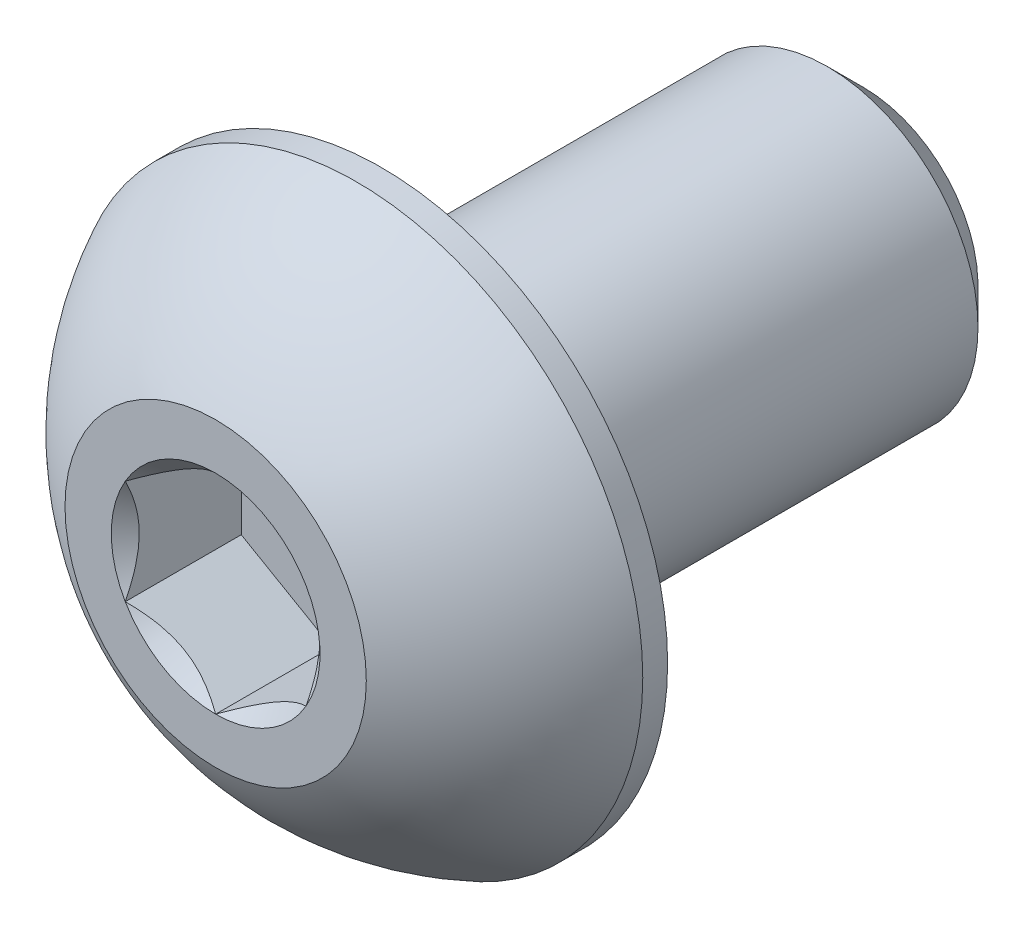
ISO-10303-21;
HEADER;
FILE_DESCRIPTION(('STEP AP214'),'2;1');
FILE_NAME('part.step','',(''),(''),'','','');
FILE_SCHEMA(('AUTOMOTIVE_DESIGN { 1 0 10303 214 1 1 1 1 }'));
ENDSEC;
DATA;
#1=APPLICATION_CONTEXT('core data for automotive mechanical design processes');
#2=APPLICATION_PROTOCOL_DEFINITION('international standard','automotive_design',2000,#1);
#3=PRODUCT_CONTEXT('',#1,'mechanical');
#4=PRODUCT('Part','Part','',(#3));
#5=PRODUCT_RELATED_PRODUCT_CATEGORY('part','',(#4));
#6=PRODUCT_DEFINITION_FORMATION('','',#4);
#7=PRODUCT_DEFINITION_CONTEXT('part definition',#1,'design');
#8=PRODUCT_DEFINITION('design','',#6,#7);
#9=PRODUCT_DEFINITION_SHAPE('','',#8);
#10=(LENGTH_UNIT() NAMED_UNIT(*) SI_UNIT(.MILLI.,.METRE.));
#11=(NAMED_UNIT(*) PLANE_ANGLE_UNIT() SI_UNIT($,.RADIAN.));
#12=(NAMED_UNIT(*) SI_UNIT($,.STERADIAN.) SOLID_ANGLE_UNIT());
#13=UNCERTAINTY_MEASURE_WITH_UNIT(LENGTH_MEASURE(1.E-05),#10,'distance_accuracy_value','');
#14=(GEOMETRIC_REPRESENTATION_CONTEXT(3) GLOBAL_UNCERTAINTY_ASSIGNED_CONTEXT((#13)) GLOBAL_UNIT_ASSIGNED_CONTEXT((#10,
#11,#12)) REPRESENTATION_CONTEXT('',''));
#15=CARTESIAN_POINT('',(0.,0.,0.));
#16=DIRECTION('',(0.,0.,1.));
#17=DIRECTION('',(1.,0.,0.));
#18=AXIS2_PLACEMENT_3D('',#15,#16,#17);
#19=CARTESIAN_POINT('',(0.,-2.50000000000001,-10.75));
#20=DIRECTION('',(0.,0.,-1.));
#21=DIRECTION('',(0.,1.,0.));
#22=AXIS2_PLACEMENT_3D('',#19,#20,#21);
#23=PLANE('',#22);
#24=CARTESIAN_POINT('',(0.,0.,-10.75));
#25=DIRECTION('',(0.,0.,-1.));
#26=DIRECTION('',(0.,1.,0.));
#27=AXIS2_PLACEMENT_3D('',#24,#25,#26);
#28=CIRCLE('',#27,1.90000000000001);
#29=CARTESIAN_POINT('',(0.,1.90000000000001,-10.75));
#30=VERTEX_POINT('',#29);
#31=EDGE_CURVE('E175',#30,#30,#28,.T.);
#32=ORIENTED_EDGE('',*,*,#31,.T.);
#33=EDGE_LOOP('',(#32));
#34=FACE_BOUND('',#33,.T.);
#35=ADVANCED_FACE('F35',(#34),#23,.T.);
#36=CARTESIAN_POINT('',(0.,0.,-10.75));
#37=DIRECTION('',(0.,0.,-1.));
#38=DIRECTION('',(0.,1.,0.));
#39=AXIS2_PLACEMENT_3D('',#36,#37,#38);
#40=CYLINDRICAL_SURFACE('',#39,2.5);
#41=CARTESIAN_POINT('',(0.,0.,-10.15));
#42=DIRECTION('',(0.,0.,-1.));
#43=DIRECTION('',(0.,1.,0.));
#44=AXIS2_PLACEMENT_3D('',#41,#42,#43);
#45=CIRCLE('',#44,2.5);
#46=CARTESIAN_POINT('',(0.,2.5,-10.15));
#47=VERTEX_POINT('',#46);
#48=EDGE_CURVE('E49',#47,#47,#45,.F.);
#49=ORIENTED_EDGE('',*,*,#48,.T.);
#50=EDGE_LOOP('',(#49));
#51=FACE_BOUND('',#50,.T.);
#52=CARTESIAN_POINT('',(0.,0.,-2.75));
#53=DIRECTION('',(0.,0.,1.));
#54=DIRECTION('',(1.,0.,0.));
#55=AXIS2_PLACEMENT_3D('',#52,#53,#54);
#56=CIRCLE('',#55,2.5);
#57=CARTESIAN_POINT('',(2.5,0.,-2.75));
#58=VERTEX_POINT('',#57);
#59=EDGE_CURVE('E172',#58,#58,#56,.F.);
#60=ORIENTED_EDGE('',*,*,#59,.T.);
#61=EDGE_LOOP('',(#60));
#62=FACE_BOUND('',#61,.T.);
#63=ADVANCED_FACE('F180',(#51,#62),#40,.T.);
#64=CARTESIAN_POINT('',(0.,0.,-10.75));
#65=DIRECTION('',(0.,0.,1.));
#66=DIRECTION('',(0.,-1.,0.));
#67=AXIS2_PLACEMENT_3D('',#64,#65,#66);
#68=CONICAL_SURFACE('',#67,1.90000000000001,0.785398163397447);
#69=ORIENTED_EDGE('',*,*,#48,.F.);
#70=EDGE_LOOP('',(#69));
#71=FACE_BOUND('',#70,.T.);
#72=ORIENTED_EDGE('',*,*,#31,.F.);
#73=EDGE_LOOP('',(#72));
#74=FACE_BOUND('',#73,.T.);
#75=ADVANCED_FACE('F37',(#71,#74),#68,.T.);
#76=CARTESIAN_POINT('',(0.,0.,-4.65805481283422));
#77=DIRECTION('',(0.,0.,1.));
#78=DIRECTION('',(0.,-1.,0.));
#79=AXIS2_PLACEMENT_3D('',#76,#77,#78);
#80=SPHERICAL_SURFACE('',#79,5.28653711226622);
#81=CARTESIAN_POINT('',(0.,0.,0.));
#82=DIRECTION('',(0.,0.,1.));
#83=DIRECTION('',(1.,0.,0.));
#84=AXIS2_PLACEMENT_3D('',#81,#82,#83);
#85=CIRCLE('',#84,2.5);
#86=CARTESIAN_POINT('',(0.,-2.50000000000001,0.));
#87=VERTEX_POINT('',#86);
#88=EDGE_CURVE('E169',#87,#87,#85,.T.);
#89=CARTESIAN_POINT('',(0.,0.,-2.3375));
#90=DIRECTION('',(0.,0.,1.));
#91=DIRECTION('',(1.,0.,0.));
#92=AXIS2_PLACEMENT_3D('',#89,#90,#91);
#93=CIRCLE('',#92,4.75);
#94=CARTESIAN_POINT('',(0.,-4.75,-2.3375));
#95=VERTEX_POINT('',#94);
#96=EDGE_CURVE('E163',#95,#95,#93,.T.);
#97=CARTESIAN_POINT('',(0.,-2.50000000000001,0.));
#98=CARTESIAN_POINT('',(0.,-2.53026679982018,-0.0162442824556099));
#99=CARTESIAN_POINT('',(0.,-2.56037522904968,-0.0327836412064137));
#100=CARTESIAN_POINT('',(0.,-2.62026400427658,-0.066446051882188));
#101=CARTESIAN_POINT('',(0.,-2.65004435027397,-0.0835691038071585));
#102=CARTESIAN_POINT('',(0.,-2.70926561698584,-0.118392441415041));
#103=CARTESIAN_POINT('',(0.,-2.73870653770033,-0.136092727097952));
#104=CARTESIAN_POINT('',(0.,-2.79723777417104,-0.172063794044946));
#105=CARTESIAN_POINT('',(0.,-2.82632808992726,-0.190334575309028));
#106=CARTESIAN_POINT('',(0.,-2.8841470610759,-0.227439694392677));
#107=CARTESIAN_POINT('',(0.,-2.91287571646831,-0.246274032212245));
#108=CARTESIAN_POINT('',(0.,-2.96996045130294,-0.284499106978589));
#109=CARTESIAN_POINT('',(0.,-2.99831653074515,-0.303889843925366));
#110=CARTESIAN_POINT('',(0.,-3.05464533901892,-0.343220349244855));
#111=CARTESIAN_POINT('',(0.,-3.08261806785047,-0.363160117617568));
#112=CARTESIAN_POINT('',(0.,-3.13816954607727,-0.403581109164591));
#113=CARTESIAN_POINT('',(0.,-3.16574829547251,-0.424062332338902));
#114=CARTESIAN_POINT('',(0.,-3.22050133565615,-0.465558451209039));
#115=CARTESIAN_POINT('',(0.,-3.24767562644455,-0.486573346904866));
#116=CARTESIAN_POINT('',(0.,-3.30160942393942,-0.529128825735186));
#117=CARTESIAN_POINT('',(0.,-3.32836893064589,-0.550669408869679));
#118=CARTESIAN_POINT('',(0.,-3.38146299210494,-0.594268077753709));
#119=CARTESIAN_POINT('',(0.,-3.40779754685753,-0.616326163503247));
#120=CARTESIAN_POINT('',(0.,-3.46003169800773,-0.660951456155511));
#121=CARTESIAN_POINT('',(0.,-3.48593129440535,-0.683518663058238));
#122=CARTESIAN_POINT('',(0.,-3.53728568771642,-0.72915362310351));
#123=CARTESIAN_POINT('',(0.,-3.56274048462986,-0.752221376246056));
#124=CARTESIAN_POINT('',(0.,-3.61319560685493,-0.79884866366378));
#125=CARTESIAN_POINT('',(0.,-3.63819593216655,-0.822408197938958));
#126=CARTESIAN_POINT('',(0.,-3.68773261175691,-0.870010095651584));
#127=CARTESIAN_POINT('',(0.,-3.71226896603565,-0.894052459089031));
#128=CARTESIAN_POINT('',(0.,-3.76086838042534,-0.942610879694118));
#129=CARTESIAN_POINT('',(0.,-3.78493144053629,-0.967126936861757));
#130=CARTESIAN_POINT('',(0.,-3.83257512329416,-1.01662342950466));
#131=CARTESIAN_POINT('',(0.,-3.85615574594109,-1.04160386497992));
#132=CARTESIAN_POINT('',(0.,-3.90282559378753,-1.0920196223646));
#133=CARTESIAN_POINT('',(0.,-3.92591481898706,-1.11745494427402));
#134=CARTESIAN_POINT('',(0.,-3.97159309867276,-1.1687708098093));
#135=CARTESIAN_POINT('',(0.,-3.99418215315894,-1.19465135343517));
#136=CARTESIAN_POINT('',(0.,-4.03885150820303,-1.24684782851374));
#137=CARTESIAN_POINT('',(0.,-4.06093180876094,-1.27316375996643));
#138=CARTESIAN_POINT('',(0.,-4.10457526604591,-1.32622101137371));
#139=CARTESIAN_POINT('',(0.,-4.12613842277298,-1.3529623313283));
#140=CARTESIAN_POINT('',(0.,-4.16873939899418,-1.40686019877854));
#141=CARTESIAN_POINT('',(0.,-4.1897772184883,-1.4340167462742));
#142=CARTESIAN_POINT('',(0.,-4.23131952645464,-1.488734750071));
#143=CARTESIAN_POINT('',(0.,-4.25182401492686,-1.51629620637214));
#144=CARTESIAN_POINT('',(0.,-4.29229186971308,-1.5718135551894));
#145=CARTESIAN_POINT('',(0.,-4.31225523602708,-1.59976944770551));
#146=CARTESIAN_POINT('',(0.,-4.35163326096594,-1.65606504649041));
#147=CARTESIAN_POINT('',(0.,-4.3710479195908,-1.6844047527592));
#148=CARTESIAN_POINT('',(0.,-4.40932115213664,-1.74145721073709));
#149=CARTESIAN_POINT('',(0.,-4.42817972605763,-1.77016996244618));
#150=CARTESIAN_POINT('',(0.,-4.46533362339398,-1.82795760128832));
#151=CARTESIAN_POINT('',(0.,-4.48362894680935,-1.85703248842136));
#152=CARTESIAN_POINT('',(0.,-4.51964939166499,-1.91553335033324));
#153=CARTESIAN_POINT('',(0.,-4.53737451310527,-1.94495932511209));
#154=CARTESIAN_POINT('',(0.,-4.57224781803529,-2.00415118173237));
#155=CARTESIAN_POINT('',(0.,-4.58939600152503,-2.03391706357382));
#156=CARTESIAN_POINT('',(0.,-4.62310891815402,-2.09377742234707));
#157=CARTESIAN_POINT('',(0.,-4.63967365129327,-2.12387189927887));
#158=CARTESIAN_POINT('',(0.,-4.67221336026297,-2.18437801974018));
#159=CARTESIAN_POINT('',(0.,-4.68818833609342,-2.21478966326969));
#160=CARTESIAN_POINT('',(0.,-4.71954250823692,-2.27591853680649));
#161=CARTESIAN_POINT('',(0.,-4.73492170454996,-2.30663576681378));
#162=CARTESIAN_POINT('',(0.,-4.75,-2.3375));
#163=B_SPLINE_CURVE_WITH_KNOTS('',3,(#97,#98,#99,#100,#101,#102,#103,#104,#105,#106,#107,#108,
#109,#110,#111,#112,#113,#114,#115,#116,#117,#118,#119,#120,#121,#122,#123,#124,#125,#126,#127,
#128,#129,#130,#131,#132,#133,#134,#135,#136,#137,#138,#139,#140,#141,#142,#143,#144,#145,#146,
#147,#148,#149,#150,#151,#152,#153,#154,#155,#156,#157,#158,#159,#160,#161,#162),.UNSPECIFIED.,
.F.,.F.,(4,2,2,2,2,2,2,2,2,2,2,2,2,2,2,2,2,2,2,2,2,2,2,2,2,2,2,2,2,2,2,2,4),(0.,
0.10304982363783,0.206099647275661,0.309149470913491,0.412199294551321,0.515249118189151,
0.618298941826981,0.721348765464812,0.824398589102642,0.927448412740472,1.0304982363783,
1.13354806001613,1.23659788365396,1.33964770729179,1.44269753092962,1.54574735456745,
1.64879717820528,1.75184700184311,1.85489682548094,1.95794664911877,2.0609964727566,
2.16404629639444,2.26709612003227,2.3701459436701,2.47319576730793,2.57624559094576,
2.67929541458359,2.78234523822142,2.88539506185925,2.98844488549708,3.09149470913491,
3.19454453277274,3.29759435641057),.UNSPECIFIED.);
#164=EDGE_CURVE('BSEAM185',#87,#95,#163,.T.);
#165=ORIENTED_EDGE('',*,*,#88,.F.);
#166=ORIENTED_EDGE('',*,*,#96,.T.);
#167=ORIENTED_EDGE('',*,*,#164,.T.);
#168=ORIENTED_EDGE('',*,*,#164,.F.);
#169=EDGE_LOOP('',(#165,#167,#166,#168));
#170=FACE_BOUND('',#169,.T.);
#171=ADVANCED_FACE('F185',(#170),#80,.T.);
#172=CARTESIAN_POINT('',(0.,-2.5,0.));
#173=DIRECTION('',(0.,0.,-1.));
#174=DIRECTION('',(-1.,0.,0.));
#175=AXIS2_PLACEMENT_3D('',#172,#173,#174);
#176=PLANE('',#175);
#177=CARTESIAN_POINT('',(0.,0.,0.));
#178=DIRECTION('',(0.,0.,1.));
#179=DIRECTION('',(1.,0.,0.));
#180=AXIS2_PLACEMENT_3D('',#177,#178,#179);
#181=CIRCLE('',#180,1.73205080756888);
#182=CARTESIAN_POINT('',(-1.5,0.866025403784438,0.));
#183=VERTEX_POINT('',#182);
#184=CARTESIAN_POINT('',(-1.5,-0.866025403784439,0.));
#185=VERTEX_POINT('',#184);
#186=EDGE_CURVE('E62',#183,#185,#181,.T.);
#187=ORIENTED_EDGE('',*,*,#186,.F.);
#188=CARTESIAN_POINT('',(0.,1.73205080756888,0.));
#189=VERTEX_POINT('',#188);
#190=EDGE_CURVE('E134',#189,#183,#181,.T.);
#191=ORIENTED_EDGE('',*,*,#190,.F.);
#192=CARTESIAN_POINT('',(1.5,0.866025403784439,0.));
#193=VERTEX_POINT('',#192);
#194=EDGE_CURVE('E131',#193,#189,#181,.T.);
#195=ORIENTED_EDGE('',*,*,#194,.F.);
#196=CARTESIAN_POINT('',(1.5,-0.866025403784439,0.));
#197=VERTEX_POINT('',#196);
#198=EDGE_CURVE('E102',#197,#193,#181,.T.);
#199=ORIENTED_EDGE('',*,*,#198,.F.);
#200=CARTESIAN_POINT('',(0.,-1.73205080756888,0.));
#201=VERTEX_POINT('',#200);
#202=EDGE_CURVE('E94',#201,#197,#181,.T.);
#203=ORIENTED_EDGE('',*,*,#202,.F.);
#204=EDGE_CURVE('E55',#185,#201,#181,.T.);
#205=ORIENTED_EDGE('',*,*,#204,.F.);
#206=EDGE_LOOP('',(#187,#191,#195,#199,#203,#205));
#207=FACE_BOUND('',#206,.T.);
#208=ORIENTED_EDGE('',*,*,#88,.T.);
#209=EDGE_LOOP('',(#208));
#210=FACE_BOUND('',#209,.T.);
#211=ADVANCED_FACE('F128',(#207,#210),#176,.F.);
#212=CARTESIAN_POINT('',(0.,-4.75,-2.75));
#213=DIRECTION('',(0.,0.,1.));
#214=DIRECTION('',(1.,0.,0.));
#215=AXIS2_PLACEMENT_3D('',#212,#213,#214);
#216=PLANE('',#215);
#217=ORIENTED_EDGE('',*,*,#59,.F.);
#218=EDGE_LOOP('',(#217));
#219=FACE_BOUND('',#218,.T.);
#220=CARTESIAN_POINT('',(0.,0.,-2.75));
#221=DIRECTION('',(0.,0.,1.));
#222=DIRECTION('',(1.,0.,0.));
#223=AXIS2_PLACEMENT_3D('',#220,#221,#222);
#224=CIRCLE('',#223,4.75);
#225=CARTESIAN_POINT('',(4.75,0.,-2.75));
#226=VERTEX_POINT('',#225);
#227=EDGE_CURVE('E166',#226,#226,#224,.T.);
#228=ORIENTED_EDGE('',*,*,#227,.F.);
#229=EDGE_LOOP('',(#228));
#230=FACE_BOUND('',#229,.T.);
#231=ADVANCED_FACE('F199',(#219,#230),#216,.F.);
#232=CARTESIAN_POINT('',(0.,0.,0.));
#233=DIRECTION('',(0.,0.,1.));
#234=DIRECTION('',(1.,0.,0.));
#235=AXIS2_PLACEMENT_3D('',#232,#233,#234);
#236=CYLINDRICAL_SURFACE('',#235,4.75);
#237=ORIENTED_EDGE('',*,*,#96,.F.);
#238=EDGE_LOOP('',(#237));
#239=FACE_BOUND('',#238,.T.);
#240=ORIENTED_EDGE('',*,*,#227,.T.);
#241=EDGE_LOOP('',(#240));
#242=FACE_BOUND('',#241,.T.);
#243=ADVANCED_FACE('F202',(#239,#242),#236,.T.);
#244=CARTESIAN_POINT('',(0.,0.,0.));
#245=DIRECTION('',(0.,0.,1.));
#246=DIRECTION('',(1.,0.,0.));
#247=AXIS2_PLACEMENT_3D('',#244,#245,#246);
#248=CONICAL_SURFACE('',#247,1.73205080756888,0.78539816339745);
#249=ORIENTED_EDGE('',*,*,#198,.T.);
#250=CARTESIAN_POINT('',(1.5,-1.72720812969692,0.555578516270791));
#251=CARTESIAN_POINT('',(1.5,-1.68515175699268,0.523829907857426));
#252=CARTESIAN_POINT('',(1.5,-1.64286104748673,0.492392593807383));
#253=CARTESIAN_POINT('',(1.5,-1.55771581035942,0.430269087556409));
#254=CARTESIAN_POINT('',(1.5,-1.51486114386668,0.399583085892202));
#255=CARTESIAN_POINT('',(1.5,-1.3846813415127,0.30840719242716));
#256=CARTESIAN_POINT('',(1.5,-1.29637976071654,0.249288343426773));
#257=CARTESIAN_POINT('',(1.5,-1.11121478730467,0.133230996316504));
#258=CARTESIAN_POINT('',(1.5,-1.01415038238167,0.0766095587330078));
#259=CARTESIAN_POINT('',(1.5,-0.815173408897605,-0.0269631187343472));
#260=CARTESIAN_POINT('',(1.5,-0.713278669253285,-0.0739469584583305));
#261=CARTESIAN_POINT('',(1.5,-0.560333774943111,-0.13142733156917));
#262=CARTESIAN_POINT('',(1.5,-0.511547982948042,-0.147924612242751));
#263=CARTESIAN_POINT('',(1.5,-0.412798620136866,-0.177002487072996));
#264=CARTESIAN_POINT('',(1.5,-0.362834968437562,-0.189582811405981));
#265=CARTESIAN_POINT('',(1.5,-0.262863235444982,-0.20996380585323));
#266=CARTESIAN_POINT('',(1.5,-0.212872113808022,-0.21784636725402));
#267=CARTESIAN_POINT('',(1.5,-0.112355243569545,-0.228677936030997));
#268=CARTESIAN_POINT('',(1.5,-0.0618295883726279,-0.231627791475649));
#269=CARTESIAN_POINT('',(1.5,0.037429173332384,-0.23237514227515));
#270=CARTESIAN_POINT('',(1.5,0.0861609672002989,-0.230355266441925));
#271=CARTESIAN_POINT('',(1.5,0.183206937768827,-0.221677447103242));
#272=CARTESIAN_POINT('',(1.5,0.231521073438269,-0.215019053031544));
#273=CARTESIAN_POINT('',(1.5,0.328199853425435,-0.197314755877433));
#274=CARTESIAN_POINT('',(1.5,0.376550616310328,-0.186194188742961));
#275=CARTESIAN_POINT('',(1.5,0.472195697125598,-0.160156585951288));
#276=CARTESIAN_POINT('',(1.5,0.51949010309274,-0.145239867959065));
#277=CARTESIAN_POINT('',(1.5,0.668391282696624,-0.0926647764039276));
#278=CARTESIAN_POINT('',(1.5,0.767878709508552,-0.0490187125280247));
#279=CARTESIAN_POINT('',(1.5,0.962179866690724,0.048022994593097));
#280=CARTESIAN_POINT('',(1.5,1.05697519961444,0.101453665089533));
#281=CARTESIAN_POINT('',(1.5,1.23814273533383,0.211685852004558));
#282=CARTESIAN_POINT('',(1.5,1.3246994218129,0.268187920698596));
#283=CARTESIAN_POINT('',(1.5,1.45222331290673,0.355534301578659));
#284=CARTESIAN_POINT('',(1.5,1.49418091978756,0.384957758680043));
#285=CARTESIAN_POINT('',(1.5,1.57752272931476,0.444582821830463));
#286=CARTESIAN_POINT('',(1.5,1.61890708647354,0.474784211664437));
#287=CARTESIAN_POINT('',(1.5,1.66005278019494,0.505308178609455));
#288=B_SPLINE_CURVE_WITH_KNOTS('',3,(#250,#251,#252,#253,#254,#255,#256,#257,#258,#259,#260,
#261,#262,#263,#264,#265,#266,#267,#268,#269,#270,#271,#272,#273,#274,#275,#276,#277,#278,#279,
#280,#281,#282,#283,#284,#285,#286,#287),.UNSPECIFIED.,.F.,.F.,(4,2,2,2,2,2,2,2,2,2,2,2,2,2,2,2,
2,2,4),(0.,0.158079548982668,0.316198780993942,0.634850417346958,0.97169031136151,
1.30737131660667,1.46173961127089,1.61611853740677,1.7677210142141,1.91929742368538,
2.065387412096,2.21149159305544,2.36014984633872,2.50879566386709,2.83376031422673,
3.15991186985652,3.46985601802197,3.62358896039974,3.7772796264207),.UNSPECIFIED.);
#289=EDGE_CURVE('E11',#197,#193,#288,.T.);
#290=ORIENTED_EDGE('',*,*,#289,.F.);
#291=EDGE_LOOP('',(#249,#290));
#292=FACE_BOUND('',#291,.T.);
#293=ADVANCED_FACE('F106',(#292),#248,.F.);
#294=ORIENTED_EDGE('',*,*,#194,.T.);
#295=CARTESIAN_POINT('',(1.5002,0.865909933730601,0.000115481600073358));
#296=CARTESIAN_POINT('',(1.44863220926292,0.895682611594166,-0.0296345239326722));
#297=CARTESIAN_POINT('',(1.3962020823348,0.925953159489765,-0.0576375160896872));
#298=CARTESIAN_POINT('',(1.2892909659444,0.987678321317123,-0.108910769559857));
#299=CARTESIAN_POINT('',(1.23479980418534,1.01913880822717,-0.132152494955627));
#300=CARTESIAN_POINT('',(1.12492091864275,1.08257741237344,-0.17196627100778));
#301=CARTESIAN_POINT('',(1.0695611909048,1.11453936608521,-0.188638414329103));
#302=CARTESIAN_POINT('',(0.95762274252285,1.1791670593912,-0.214325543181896));
#303=CARTESIAN_POINT('',(0.901047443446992,1.21183082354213,-0.223359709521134));
#304=CARTESIAN_POINT('',(0.80354461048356,1.26812411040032,-0.231510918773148));
#305=CARTESIAN_POINT('',(0.762743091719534,1.29168087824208,-0.232717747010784));
#306=CARTESIAN_POINT('',(0.681212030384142,1.33875285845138,-0.230685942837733));
#307=CARTESIAN_POINT('',(0.64048250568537,1.36226806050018,-0.227446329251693));
#308=CARTESIAN_POINT('',(0.559415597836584,1.40907206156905,-0.216708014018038));
#309=CARTESIAN_POINT('',(0.519078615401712,1.43236062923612,-0.209205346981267));
#310=CARTESIAN_POINT('',(0.43908166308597,1.47854689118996,-0.19034838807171));
#311=CARTESIAN_POINT('',(0.399421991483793,1.50144441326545,-0.178992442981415));
#312=CARTESIAN_POINT('',(0.297836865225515,1.56009461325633,-0.145278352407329));
#313=CARTESIAN_POINT('',(0.236541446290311,1.59548353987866,-0.120378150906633));
#314=CARTESIAN_POINT('',(0.146414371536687,1.64751843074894,-0.078343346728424));
#315=CARTESIAN_POINT('',(0.116714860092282,1.66466545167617,-0.0635748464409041));
#316=CARTESIAN_POINT('',(0.0578620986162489,1.69864410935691,-0.0326894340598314));
#317=CARTESIAN_POINT('',(0.0287085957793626,1.71547589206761,-0.0165731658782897));
#318=CARTESIAN_POINT('',(-0.000200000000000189,1.73216627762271,0.000115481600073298));
#319=B_SPLINE_CURVE_WITH_KNOTS('',3,(#295,#296,#297,#298,#299,#300,#301,#302,#303,#304,#305,
#306,#307,#308,#309,#310,#311,#312,#313,#314,#315,#316,#317,#318),.UNSPECIFIED.,.F.,.F.,(4,2,2,
2,2,2,2,2,2,2,2,4),(0.,0.199829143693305,0.400822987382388,0.59862372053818,0.795926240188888,
0.93711306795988,1.07833105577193,1.21968061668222,1.36109089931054,1.58570969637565,
1.69770705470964,1.80965120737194),.UNSPECIFIED.);
#320=EDGE_CURVE('E133',#193,#189,#319,.T.);
#321=ORIENTED_EDGE('',*,*,#320,.F.);
#322=EDGE_LOOP('',(#294,#321));
#323=FACE_BOUND('',#322,.T.);
#324=ADVANCED_FACE('F287',(#323),#248,.F.);
#325=ORIENTED_EDGE('',*,*,#190,.T.);
#326=CARTESIAN_POINT('',(0.000199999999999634,1.73216627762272,0.000115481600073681));
#327=CARTESIAN_POINT('',(-0.0513677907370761,1.70239359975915,-0.029634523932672));
#328=CARTESIAN_POINT('',(-0.103797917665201,1.67212305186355,-0.0576375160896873));
#329=CARTESIAN_POINT('',(-0.210709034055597,1.61039789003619,-0.108910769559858));
#330=CARTESIAN_POINT('',(-0.265200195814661,1.57893740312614,-0.132152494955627));
#331=CARTESIAN_POINT('',(-0.375079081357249,1.51549879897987,-0.17196627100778));
#332=CARTESIAN_POINT('',(-0.4304388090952,1.4835368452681,-0.188638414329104));
#333=CARTESIAN_POINT('',(-0.542377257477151,1.41890915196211,-0.214325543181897));
#334=CARTESIAN_POINT('',(-0.598952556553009,1.38624538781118,-0.223359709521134));
#335=CARTESIAN_POINT('',(-0.696455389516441,1.32995210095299,-0.231510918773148));
#336=CARTESIAN_POINT('',(-0.737256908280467,1.30639533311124,-0.232717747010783));
#337=CARTESIAN_POINT('',(-0.818787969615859,1.25932335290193,-0.230685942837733));
#338=CARTESIAN_POINT('',(-0.859517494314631,1.23580815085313,-0.227446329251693));
#339=CARTESIAN_POINT('',(-0.940584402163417,1.18900414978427,-0.216708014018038));
#340=CARTESIAN_POINT('',(-0.980921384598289,1.16571558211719,-0.209205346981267));
#341=CARTESIAN_POINT('',(-1.06091833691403,1.11952932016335,-0.19034838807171));
#342=CARTESIAN_POINT('',(-1.10057800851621,1.09663179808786,-0.178992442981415));
#343=CARTESIAN_POINT('',(-1.20216313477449,1.03798159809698,-0.145278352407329));
#344=CARTESIAN_POINT('',(-1.26345855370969,1.00259267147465,-0.120378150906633));
#345=CARTESIAN_POINT('',(-1.35358562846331,0.950557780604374,-0.0783433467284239));
#346=CARTESIAN_POINT('',(-1.38328513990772,0.933410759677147,-0.0635748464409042));
#347=CARTESIAN_POINT('',(-1.44213790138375,0.899432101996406,-0.0326894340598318));
#348=CARTESIAN_POINT('',(-1.47129140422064,0.882600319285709,-0.0165731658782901));
#349=CARTESIAN_POINT('',(-1.5002,0.8659099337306,0.000115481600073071));
#350=B_SPLINE_CURVE_WITH_KNOTS('',3,(#326,#327,#328,#329,#330,#331,#332,#333,#334,#335,#336,
#337,#338,#339,#340,#341,#342,#343,#344,#345,#346,#347,#348,#349),.UNSPECIFIED.,.F.,.F.,(4,2,2,
2,2,2,2,2,2,2,2,4),(0.,0.199829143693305,0.400822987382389,0.598623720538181,0.79592624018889,
0.937113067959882,1.07833105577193,1.21968061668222,1.36109089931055,1.58570969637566,
1.69770705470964,1.80965120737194),.UNSPECIFIED.);
#351=EDGE_CURVE('E138',#189,#183,#350,.T.);
#352=ORIENTED_EDGE('',*,*,#351,.F.);
#353=EDGE_LOOP('',(#325,#352));
#354=FACE_BOUND('',#353,.T.);
#355=ADVANCED_FACE('F141',(#354),#248,.F.);
#356=ORIENTED_EDGE('',*,*,#186,.T.);
#357=CARTESIAN_POINT('',(-1.5,-1.72720812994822,0.555578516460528));
#358=CARTESIAN_POINT('',(-1.5,-1.68515175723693,0.523829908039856));
#359=CARTESIAN_POINT('',(-1.5,-1.64286104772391,0.492392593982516));
#360=CARTESIAN_POINT('',(-1.5,-1.55771581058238,0.430269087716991));
#361=CARTESIAN_POINT('',(-1.5,-1.5148611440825,0.39958308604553));
#362=CARTESIAN_POINT('',(-1.5,-1.38468134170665,0.308407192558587));
#363=CARTESIAN_POINT('',(-1.5,-1.29637976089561,0.249288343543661));
#364=CARTESIAN_POINT('',(-1.5,-1.11121478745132,0.133230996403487));
#365=CARTESIAN_POINT('',(-1.5,-1.01415038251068,0.0766095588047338));
#366=CARTESIAN_POINT('',(-1.5,-0.815173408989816,-0.0269631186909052));
#367=CARTESIAN_POINT('',(-1.5,-0.713278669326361,-0.0739469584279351));
#368=CARTESIAN_POINT('',(-1.5,-0.56033377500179,-0.131427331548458));
#369=CARTESIAN_POINT('',(-1.5,-0.51154798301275,-0.147924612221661));
#370=CARTESIAN_POINT('',(-1.5,-0.412798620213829,-0.17700248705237));
#371=CARTESIAN_POINT('',(-1.5,-0.362834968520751,-0.189582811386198));
#372=CARTESIAN_POINT('',(-1.5,-0.262863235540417,-0.209963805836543));
#373=CARTESIAN_POINT('',(-1.5,-0.212872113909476,-0.21784636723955));
#374=CARTESIAN_POINT('',(-1.5,-0.112355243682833,-0.228677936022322));
#375=CARTESIAN_POINT('',(-1.5,-0.0618295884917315,-0.231627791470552));
#376=CARTESIAN_POINT('',(-1.5,0.0374291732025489,-0.232375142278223));
#377=CARTESIAN_POINT('',(-1.5,0.0861609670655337,-0.23035526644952));
#378=CARTESIAN_POINT('',(-1.5,0.183206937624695,-0.221677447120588));
#379=CARTESIAN_POINT('',(-1.5,0.2315210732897,-0.215019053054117));
#380=CARTESIAN_POINT('',(-1.5,0.328199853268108,-0.197314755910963));
#381=CARTESIAN_POINT('',(-1.5,0.376550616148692,-0.186194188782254));
#382=CARTESIAN_POINT('',(-1.5,0.47219569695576,-0.160156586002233));
#383=CARTESIAN_POINT('',(-1.5,0.519490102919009,-0.145239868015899));
#384=CARTESIAN_POINT('',(-1.5,0.668391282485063,-0.0926647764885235));
#385=CARTESIAN_POINT('',(-1.5,0.767878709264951,-0.0490187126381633));
#386=CARTESIAN_POINT('',(-1.5,0.9621798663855,0.0480229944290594));
#387=CARTESIAN_POINT('',(-1.5,1.05697519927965,0.101453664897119));
#388=CARTESIAN_POINT('',(-1.5,1.23814273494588,0.211685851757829));
#389=CARTESIAN_POINT('',(-1.5,1.32469942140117,0.268187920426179));
#390=CARTESIAN_POINT('',(-1.5,1.45222331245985,0.355534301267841));
#391=CARTESIAN_POINT('',(-1.5,1.49418091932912,0.384957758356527));
#392=CARTESIAN_POINT('',(-1.5,1.5775227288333,0.444582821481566));
#393=CARTESIAN_POINT('',(-1.5,1.6189070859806,0.474784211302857));
#394=CARTESIAN_POINT('',(-1.5,1.66005277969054,0.505308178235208));
#395=B_SPLINE_CURVE_WITH_KNOTS('',3,(#357,#358,#359,#360,#361,#362,#363,#364,#365,#366,#367,
#368,#369,#370,#371,#372,#373,#374,#375,#376,#377,#378,#379,#380,#381,#382,#383,#384,#385,#386,
#387,#388,#389,#390,#391,#392,#393,#394),.UNSPECIFIED.,.F.,.F.,(4,2,2,2,2,2,2,2,2,2,2,2,2,2,2,2,
2,2,4),(0.,0.158079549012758,0.316198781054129,0.634850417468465,0.971690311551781,
1.30737131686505,1.46173961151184,1.61611853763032,1.76772101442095,1.91929742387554,
2.06538741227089,2.21149159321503,2.36014984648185,2.50879566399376,2.83376031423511,
3.15991186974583,3.4698560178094,3.62358896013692,3.77727962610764),.UNSPECIFIED.);
#396=EDGE_CURVE('E145',#183,#185,#395,.F.);
#397=ORIENTED_EDGE('',*,*,#396,.F.);
#398=EDGE_LOOP('',(#356,#397));
#399=FACE_BOUND('',#398,.T.);
#400=ADVANCED_FACE('F281',(#399),#248,.F.);
#401=ORIENTED_EDGE('',*,*,#204,.T.);
#402=CARTESIAN_POINT('',(-1.5002,-0.865909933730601,0.000115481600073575));
#403=CARTESIAN_POINT('',(-1.44863220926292,-0.895682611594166,-0.029634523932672));
#404=CARTESIAN_POINT('',(-1.3962020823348,-0.925953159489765,-0.0576375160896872));
#405=CARTESIAN_POINT('',(-1.2892909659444,-0.987678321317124,-0.108910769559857));
#406=CARTESIAN_POINT('',(-1.23479980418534,-1.01913880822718,-0.132152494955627));
#407=CARTESIAN_POINT('',(-1.12492091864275,-1.08257741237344,-0.17196627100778));
#408=CARTESIAN_POINT('',(-1.0695611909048,-1.11453936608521,-0.188638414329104));
#409=CARTESIAN_POINT('',(-0.957622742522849,-1.1791670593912,-0.214325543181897));
#410=CARTESIAN_POINT('',(-0.901047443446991,-1.21183082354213,-0.223359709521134));
#411=CARTESIAN_POINT('',(-0.803544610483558,-1.26812411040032,-0.231510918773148));
#412=CARTESIAN_POINT('',(-0.762743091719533,-1.29168087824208,-0.232717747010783));
#413=CARTESIAN_POINT('',(-0.681212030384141,-1.33875285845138,-0.230685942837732));
#414=CARTESIAN_POINT('',(-0.640482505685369,-1.36226806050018,-0.227446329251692));
#415=CARTESIAN_POINT('',(-0.559415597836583,-1.40907206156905,-0.216708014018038));
#416=CARTESIAN_POINT('',(-0.519078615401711,-1.43236062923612,-0.209205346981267));
#417=CARTESIAN_POINT('',(-0.439081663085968,-1.47854689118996,-0.190348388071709));
#418=CARTESIAN_POINT('',(-0.399421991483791,-1.50144441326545,-0.178992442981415));
#419=CARTESIAN_POINT('',(-0.297836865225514,-1.56009461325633,-0.145278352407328));
#420=CARTESIAN_POINT('',(-0.23654144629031,-1.59548353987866,-0.120378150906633));
#421=CARTESIAN_POINT('',(-0.146414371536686,-1.64751843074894,-0.0783433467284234));
#422=CARTESIAN_POINT('',(-0.116714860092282,-1.66466545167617,-0.0635748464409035));
#423=CARTESIAN_POINT('',(-0.0578620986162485,-1.69864410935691,-0.0326894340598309));
#424=CARTESIAN_POINT('',(-0.0287085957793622,-1.71547589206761,-0.0165731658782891));
#425=CARTESIAN_POINT('',(0.00020000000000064,-1.73216627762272,0.000115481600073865));
#426=B_SPLINE_CURVE_WITH_KNOTS('',3,(#402,#403,#404,#405,#406,#407,#408,#409,#410,#411,#412,
#413,#414,#415,#416,#417,#418,#419,#420,#421,#422,#423,#424,#425),.UNSPECIFIED.,.F.,.F.,(4,2,2,
2,2,2,2,2,2,2,2,4),(0.,0.199829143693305,0.400822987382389,0.598623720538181,0.79592624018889,
0.937113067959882,1.07833105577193,1.21968061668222,1.36109089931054,1.58570969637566,
1.69770705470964,1.80965120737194),.UNSPECIFIED.);
#427=EDGE_CURVE('E118',#185,#201,#426,.T.);
#428=ORIENTED_EDGE('',*,*,#427,.F.);
#429=EDGE_LOOP('',(#401,#428));
#430=FACE_BOUND('',#429,.T.);
#431=ADVANCED_FACE('F229',(#430),#248,.F.);
#432=ORIENTED_EDGE('',*,*,#202,.T.);
#433=CARTESIAN_POINT('',(-0.000199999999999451,-1.73216627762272,0.000115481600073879));
#434=CARTESIAN_POINT('',(0.0513677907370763,-1.70239359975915,-0.029634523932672));
#435=CARTESIAN_POINT('',(0.103797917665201,-1.67212305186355,-0.0576375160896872));
#436=CARTESIAN_POINT('',(0.210709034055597,-1.61039789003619,-0.108910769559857));
#437=CARTESIAN_POINT('',(0.265200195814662,-1.57893740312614,-0.132152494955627));
#438=CARTESIAN_POINT('',(0.375079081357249,-1.51549879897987,-0.17196627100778));
#439=CARTESIAN_POINT('',(0.4304388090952,-1.4835368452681,-0.188638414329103));
#440=CARTESIAN_POINT('',(0.542377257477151,-1.41890915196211,-0.214325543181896));
#441=CARTESIAN_POINT('',(0.598952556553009,-1.38624538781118,-0.223359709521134));
#442=CARTESIAN_POINT('',(0.696455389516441,-1.32995210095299,-0.231510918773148));
#443=CARTESIAN_POINT('',(0.737256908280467,-1.30639533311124,-0.232717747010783));
#444=CARTESIAN_POINT('',(0.818787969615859,-1.25932335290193,-0.230685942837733));
#445=CARTESIAN_POINT('',(0.85951749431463,-1.23580815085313,-0.227446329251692));
#446=CARTESIAN_POINT('',(0.940584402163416,-1.18900414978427,-0.216708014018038));
#447=CARTESIAN_POINT('',(0.980921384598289,-1.16571558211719,-0.209205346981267));
#448=CARTESIAN_POINT('',(1.06091833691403,-1.11952932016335,-0.19034838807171));
#449=CARTESIAN_POINT('',(1.10057800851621,-1.09663179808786,-0.178992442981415));
#450=CARTESIAN_POINT('',(1.20216313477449,-1.03798159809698,-0.145278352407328));
#451=CARTESIAN_POINT('',(1.26345855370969,-1.00259267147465,-0.120378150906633));
#452=CARTESIAN_POINT('',(1.35358562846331,-0.950557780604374,-0.0783433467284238));
#453=CARTESIAN_POINT('',(1.38328513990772,-0.933410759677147,-0.063574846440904));
#454=CARTESIAN_POINT('',(1.44213790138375,-0.899432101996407,-0.0326894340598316));
#455=CARTESIAN_POINT('',(1.47129140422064,-0.88260031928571,-0.0165731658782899));
#456=CARTESIAN_POINT('',(1.5002,-0.865909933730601,0.000115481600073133));
#457=B_SPLINE_CURVE_WITH_KNOTS('',3,(#433,#434,#435,#436,#437,#438,#439,#440,#441,#442,#443,
#444,#445,#446,#447,#448,#449,#450,#451,#452,#453,#454,#455,#456),.UNSPECIFIED.,.F.,.F.,(4,2,2,
2,2,2,2,2,2,2,2,4),(0.,0.199829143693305,0.400822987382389,0.598623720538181,0.795926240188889,
0.937113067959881,1.07833105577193,1.21968061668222,1.36109089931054,1.58570969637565,
1.69770705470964,1.80965120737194),.UNSPECIFIED.);
#458=EDGE_CURVE('E98',#201,#197,#457,.T.);
#459=ORIENTED_EDGE('',*,*,#458,.F.);
#460=EDGE_LOOP('',(#432,#459));
#461=FACE_BOUND('',#460,.T.);
#462=ADVANCED_FACE('F96',(#461),#248,.F.);
#463=CARTESIAN_POINT('',(1.5,-0.866025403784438,-1.925));
#464=DIRECTION('',(0.,0.,1.));
#465=DIRECTION('',(1.,0.,0.));
#466=AXIS2_PLACEMENT_3D('',#463,#464,#465);
#467=PLANE('',#466);
#468=DIRECTION('',(0.866025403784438,0.5,0.));
#469=VECTOR('',#468,1.);
#470=CARTESIAN_POINT('',(0.,-1.73205080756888,-1.925));
#471=LINE('',#470,#469);
#472=CARTESIAN_POINT('',(0.,-1.73205080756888,-1.925));
#473=VERTEX_POINT('',#472);
#474=CARTESIAN_POINT('',(1.5,-0.866025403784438,-1.925));
#475=VERTEX_POINT('',#474);
#476=EDGE_CURVE('E117',#473,#475,#471,.T.);
#477=ORIENTED_EDGE('',*,*,#476,.T.);
#478=DIRECTION('',(0.,1.,0.));
#479=VECTOR('',#478,1.);
#480=CARTESIAN_POINT('',(1.5,-0.866025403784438,-1.925));
#481=LINE('',#480,#479);
#482=CARTESIAN_POINT('',(1.5,0.866025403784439,-1.925));
#483=VERTEX_POINT('',#482);
#484=EDGE_CURVE('E122',#475,#483,#481,.T.);
#485=ORIENTED_EDGE('',*,*,#484,.T.);
#486=DIRECTION('',(-0.866025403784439,0.5,0.));
#487=VECTOR('',#486,1.);
#488=CARTESIAN_POINT('',(1.5,0.866025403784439,-1.925));
#489=LINE('',#488,#487);
#490=CARTESIAN_POINT('',(0.,1.73205080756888,-1.925));
#491=VERTEX_POINT('',#490);
#492=EDGE_CURVE('E271',#483,#491,#489,.T.);
#493=ORIENTED_EDGE('',*,*,#492,.T.);
#494=DIRECTION('',(-0.866025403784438,-0.5,0.));
#495=VECTOR('',#494,1.);
#496=CARTESIAN_POINT('',(0.,1.73205080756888,-1.925));
#497=LINE('',#496,#495);
#498=CARTESIAN_POINT('',(-1.5,0.866025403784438,-1.925));
#499=VERTEX_POINT('',#498);
#500=EDGE_CURVE('E154',#491,#499,#497,.T.);
#501=ORIENTED_EDGE('',*,*,#500,.T.);
#502=DIRECTION('',(0.,-1.,0.));
#503=VECTOR('',#502,1.);
#504=CARTESIAN_POINT('',(-1.5,0.866025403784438,-1.925));
#505=LINE('',#504,#503);
#506=CARTESIAN_POINT('',(-1.5,-0.866025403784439,-1.925));
#507=VERTEX_POINT('',#506);
#508=EDGE_CURVE('E275',#499,#507,#505,.T.);
#509=ORIENTED_EDGE('',*,*,#508,.T.);
#510=DIRECTION('',(0.866025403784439,-0.5,0.));
#511=VECTOR('',#510,1.);
#512=CARTESIAN_POINT('',(-1.5,-0.866025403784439,-1.925));
#513=LINE('',#512,#511);
#514=EDGE_CURVE('E125',#507,#473,#513,.T.);
#515=ORIENTED_EDGE('',*,*,#514,.T.);
#516=EDGE_LOOP('',(#477,#485,#493,#501,#509,#515));
#517=FACE_BOUND('',#516,.T.);
#518=ADVANCED_FACE('F228',(#517),#467,.T.);
#519=CARTESIAN_POINT('',(1.5,-0.866025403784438,-1.925));
#520=DIRECTION('',(1.,0.,0.));
#521=DIRECTION('',(0.,0.,-1.));
#522=AXIS2_PLACEMENT_3D('',#519,#520,#521);
#523=PLANE('',#522);
#524=DIRECTION('',(0.,0.,1.));
#525=VECTOR('',#524,1.);
#526=CARTESIAN_POINT('',(1.5,-0.866025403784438,-1.925));
#527=LINE('',#526,#525);
#528=EDGE_CURVE('E114',#475,#197,#527,.T.);
#529=ORIENTED_EDGE('',*,*,#528,.T.);
#530=ORIENTED_EDGE('',*,*,#289,.T.);
#531=DIRECTION('',(0.,0.,1.));
#532=VECTOR('',#531,1.);
#533=CARTESIAN_POINT('',(1.5,0.866025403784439,-1.925));
#534=LINE('',#533,#532);
#535=EDGE_CURVE('E124',#483,#193,#534,.T.);
#536=ORIENTED_EDGE('',*,*,#535,.F.);
#537=ORIENTED_EDGE('',*,*,#484,.F.);
#538=EDGE_LOOP('',(#529,#530,#536,#537));
#539=FACE_BOUND('',#538,.T.);
#540=ADVANCED_FACE('F120',(#539),#523,.F.);
#541=CARTESIAN_POINT('',(1.5,0.866025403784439,-1.925));
#542=DIRECTION('',(0.5,0.866025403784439,0.));
#543=DIRECTION('',(-0.866025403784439,0.5,0.));
#544=AXIS2_PLACEMENT_3D('',#541,#542,#543);
#545=PLANE('',#544);
#546=ORIENTED_EDGE('',*,*,#535,.T.);
#547=ORIENTED_EDGE('',*,*,#320,.T.);
#548=DIRECTION('',(0.,0.,1.));
#549=VECTOR('',#548,1.);
#550=CARTESIAN_POINT('',(0.,1.73205080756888,-1.925));
#551=LINE('',#550,#549);
#552=EDGE_CURVE('E150',#491,#189,#551,.T.);
#553=ORIENTED_EDGE('',*,*,#552,.F.);
#554=ORIENTED_EDGE('',*,*,#492,.F.);
#555=EDGE_LOOP('',(#546,#547,#553,#554));
#556=FACE_BOUND('',#555,.T.);
#557=ADVANCED_FACE('F148',(#556),#545,.F.);
#558=CARTESIAN_POINT('',(0.,1.73205080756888,-1.925));
#559=DIRECTION('',(-0.5,0.866025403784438,0.));
#560=DIRECTION('',(-0.866025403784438,-0.5,0.));
#561=AXIS2_PLACEMENT_3D('',#558,#559,#560);
#562=PLANE('',#561);
#563=ORIENTED_EDGE('',*,*,#552,.T.);
#564=ORIENTED_EDGE('',*,*,#351,.T.);
#565=DIRECTION('',(0.,0.,1.));
#566=VECTOR('',#565,1.);
#567=CARTESIAN_POINT('',(-1.5,0.866025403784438,-1.925));
#568=LINE('',#567,#566);
#569=EDGE_CURVE('E156',#499,#183,#568,.T.);
#570=ORIENTED_EDGE('',*,*,#569,.F.);
#571=ORIENTED_EDGE('',*,*,#500,.F.);
#572=EDGE_LOOP('',(#563,#564,#570,#571));
#573=FACE_BOUND('',#572,.T.);
#574=ADVANCED_FACE('F152',(#573),#562,.F.);
#575=CARTESIAN_POINT('',(-1.5,0.866025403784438,-1.925));
#576=DIRECTION('',(-1.,0.,0.));
#577=DIRECTION('',(0.,-1.,0.));
#578=AXIS2_PLACEMENT_3D('',#575,#576,#577);
#579=PLANE('',#578);
#580=ORIENTED_EDGE('',*,*,#569,.T.);
#581=ORIENTED_EDGE('',*,*,#396,.T.);
#582=DIRECTION('',(0.,0.,1.));
#583=VECTOR('',#582,1.);
#584=CARTESIAN_POINT('',(-1.5,-0.866025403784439,-1.925));
#585=LINE('',#584,#583);
#586=EDGE_CURVE('E158',#507,#185,#585,.T.);
#587=ORIENTED_EDGE('',*,*,#586,.F.);
#588=ORIENTED_EDGE('',*,*,#508,.F.);
#589=EDGE_LOOP('',(#580,#581,#587,#588));
#590=FACE_BOUND('',#589,.T.);
#591=ADVANCED_FACE('F250',(#590),#579,.F.);
#592=CARTESIAN_POINT('',(-1.5,-0.866025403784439,-1.925));
#593=DIRECTION('',(-0.5,-0.866025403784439,0.));
#594=DIRECTION('',(0.866025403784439,-0.5,0.));
#595=AXIS2_PLACEMENT_3D('',#592,#593,#594);
#596=PLANE('',#595);
#597=ORIENTED_EDGE('',*,*,#586,.T.);
#598=ORIENTED_EDGE('',*,*,#427,.T.);
#599=DIRECTION('',(0.,0.,1.));
#600=VECTOR('',#599,1.);
#601=CARTESIAN_POINT('',(0.,-1.73205080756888,-1.925));
#602=LINE('',#601,#600);
#603=EDGE_CURVE('E116',#473,#201,#602,.T.);
#604=ORIENTED_EDGE('',*,*,#603,.F.);
#605=ORIENTED_EDGE('',*,*,#514,.F.);
#606=EDGE_LOOP('',(#597,#598,#604,#605));
#607=FACE_BOUND('',#606,.T.);
#608=ADVANCED_FACE('F209',(#607),#596,.F.);
#609=CARTESIAN_POINT('',(0.,-1.73205080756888,-1.925));
#610=DIRECTION('',(0.5,-0.866025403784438,0.));
#611=DIRECTION('',(0.866025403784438,0.5,0.));
#612=AXIS2_PLACEMENT_3D('',#609,#610,#611);
#613=PLANE('',#612);
#614=ORIENTED_EDGE('',*,*,#603,.T.);
#615=ORIENTED_EDGE('',*,*,#458,.T.);
#616=ORIENTED_EDGE('',*,*,#528,.F.);
#617=ORIENTED_EDGE('',*,*,#476,.F.);
#618=EDGE_LOOP('',(#614,#615,#616,#617));
#619=FACE_BOUND('',#618,.T.);
#620=ADVANCED_FACE('F112',(#619),#613,.F.);
#621=CLOSED_SHELL('',(#35,#63,#75,#171,#211,#231,#243,#293,#324,#355,#400,#431,#462,#518,#540,
#557,#574,#591,#608,#620));
#622=MANIFOLD_SOLID_BREP('B2',#621);
#623=ADVANCED_BREP_SHAPE_REPRESENTATION('',(#18,#622),#14);
#624=SHAPE_DEFINITION_REPRESENTATION(#9,#623);
ENDSEC;
END-ISO-10303-21;
